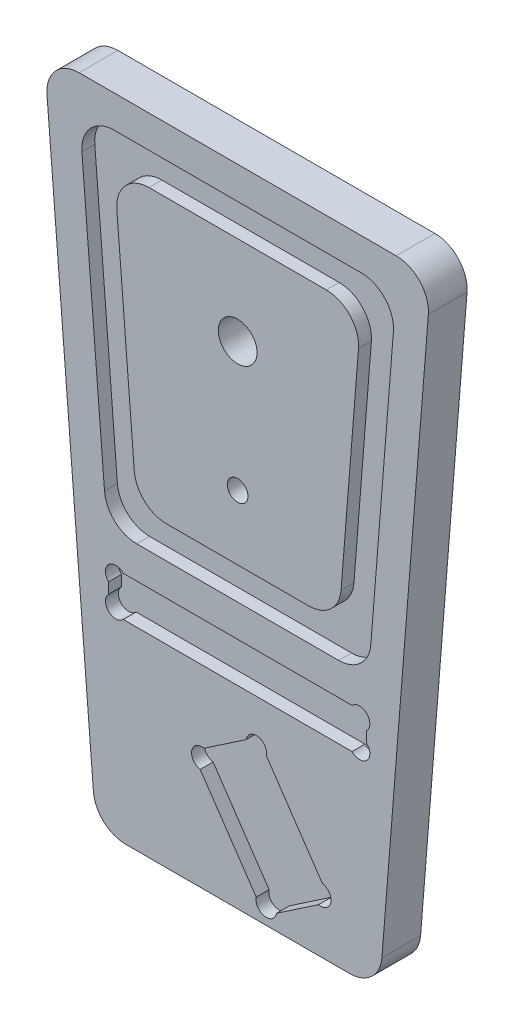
from build123d import *

# Parameters (mm, degrees)
EXTRUSION1_DEPTH        = 6
CONG_1_R                = 5
ESQUISSE3_W             = 40
ESQUISSE3_H             = 6.2
ENL_V_MAT_EXTRU_1_DEPTH = 2
ENL_V_MAT_EXTRU_3_DEPTH = 2
CONG_2_R                = 5
ESQUISSE4_R             = 1.6
ESQUISSE4_R_2           = 3
ENL_V_MAT_EXTRU_2_DEPTH = 6
ENL_V_MAT_EXTRU_8_DEPTH = 2
CONG_3_R                = 5
ESQUISSE8_R             = 1.6
ENL_V_MAT_EXTRU_9_DEPTH = 2


with BuildPart() as part:
    # Esquisse1 → Extrusion1 (new body)
    with BuildSketch(Plane.XY):
        Polygon((-22, -40), (-30, 60), (30, 60), (22, -40), align=None)
    extrude(amount=EXTRUSION1_DEPTH)

    # Cong_1
    cong_1_edges = [part.edges().sort_by_distance(p)[0] for p in [
        (-22, -40, 3),
        (-30, 60, 3),
        (30, 60, 3),
    ]]
    fillet(cong_1_edges, radius=CONG_1_R)

    # Esquisse3 → Enl_v. mat.-Extru.1 (cut)
    with BuildSketch(Plane.XY.offset(6)):
        with Locations((0, -6.9)):
            Rectangle(ESQUISSE3_W, ESQUISSE3_H)
    extrude(amount=-ENL_V_MAT_EXTRU_1_DEPTH, mode=Mode.SUBTRACT)

    # Esquisse5 → Enl_v. mat.-Extru.3 (cut)
    with BuildSketch(Plane.XY.offset(6)):
        Polygon((24.584025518, 55), (-24.584025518, 55), (-20.280025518, 1.2), (20.280025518, 1.2), align=None)
        Polygon((19.168051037, 50), (-19.168051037, 50), (-15.664051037, 6.2), (15.664051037, 6.2), align=None, mode=Mode.SUBTRACT)
    extrude(amount=-ENL_V_MAT_EXTRU_3_DEPTH, mode=Mode.SUBTRACT)

    # Cong_2
    cong_2_edges = [part.edges().sort_by_distance(p)[0] for p in [
        (-20.280025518, 1.2, 5),
        (-24.584025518, 55, 5),
        (24.584025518, 55, 5),
        (20.280025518, 1.2, 5),
        (-19.168051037, 50, 5),
        (19.168051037, 50, 5),
        (15.664051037, 6.2, 5),
        (-15.664051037, 6.2, 5),
    ]]
    fillet(cong_2_edges, radius=CONG_2_R)

    # Esquisse4 → Enl_v. mat.-Extru.2 (cut)
    with BuildSketch(Plane.XY.offset(6)):
        with Locations((0, 16.2)):
            Circle(ESQUISSE4_R)
        with Locations((0, 36.2)):
            Circle(ESQUISSE4_R_2)
    extrude(amount=-ENL_V_MAT_EXTRU_2_DEPTH, mode=Mode.SUBTRACT)

    # Esquisse6 → Enl_v. mat.-Extru.8 (cut)
    with BuildSketch(Plane.XY.offset(6)):
        Polygon((-7.080116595, -22.300544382), (3.180545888, -15.337872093), (14.410662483, -31.887327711), (4.15, -38.85), align=None)
    extrude(amount=-ENL_V_MAT_EXTRU_8_DEPTH, mode=Mode.SUBTRACT)

    # Cong_3
    cong_3_edges = [part.edges().sort_by_distance(p)[0] for p in [
        (22, -40, 3),
    ]]
    fillet(cong_3_edges, radius=CONG_3_R)

    # Esquisse8 → Enl_v. mat.-Extru.9 (cut)
    with BuildSketch(Plane.XY.offset(6)):
        with Locations((-18.9, -4.9)):
            Circle(ESQUISSE8_R)
        with Locations((-18.9, -8.9)):
            Circle(ESQUISSE8_R)
        with Locations((18.9, -4.9)):
            Circle(ESQUISSE8_R)
        with Locations((18.9, -8.9)):
            Circle(ESQUISSE8_R)
        with Locations((2.887982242, -16.865748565)):
            Circle(ESQUISSE8_R)
        with Locations((-5.552240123, -22.593108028)):
            Circle(ESQUISSE8_R)
        with Locations((4.442563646, -37.322123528)):
            Circle(ESQUISSE8_R)
        with Locations((12.882786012, -31.594764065)):
            Circle(ESQUISSE8_R)
    extrude(amount=-ENL_V_MAT_EXTRU_9_DEPTH, mode=Mode.SUBTRACT)


solid = part.part
